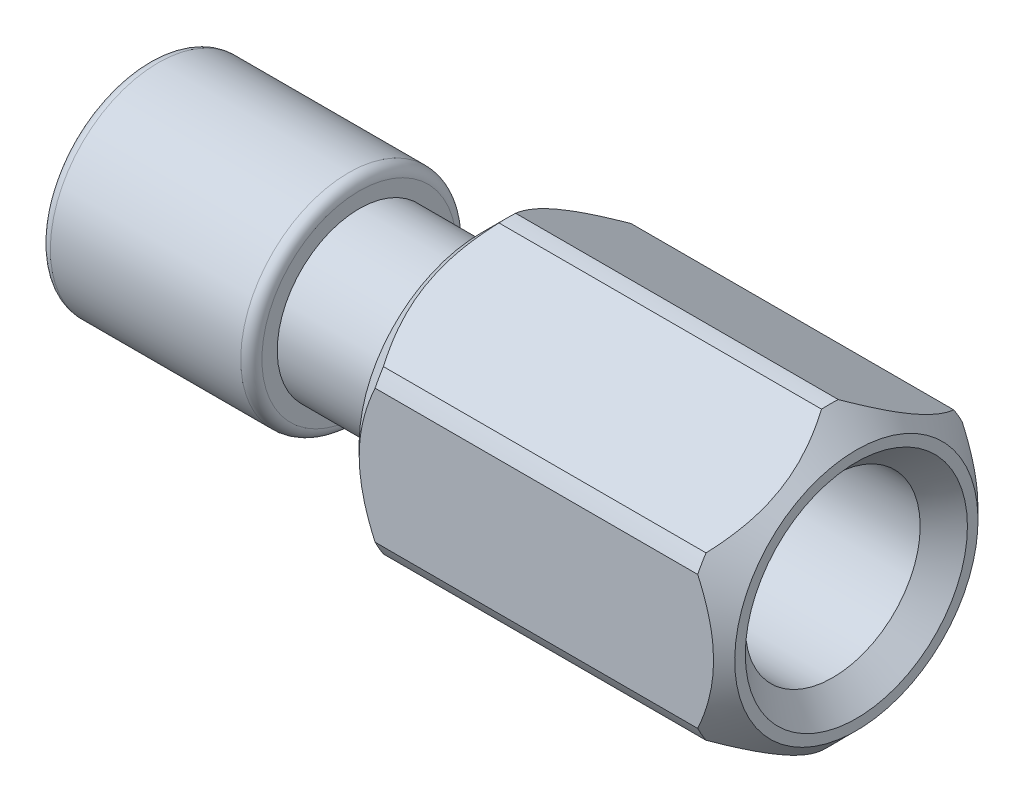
ISO-10303-21;
HEADER;
FILE_DESCRIPTION(('STEP AP214'),'2;1');
FILE_NAME('part.step','',(''),(''),'','','');
FILE_SCHEMA(('AUTOMOTIVE_DESIGN { 1 0 10303 214 1 1 1 1 }'));
ENDSEC;
DATA;
#1=APPLICATION_CONTEXT('core data for automotive mechanical design processes');
#2=APPLICATION_PROTOCOL_DEFINITION('international standard','automotive_design',2000,#1);
#3=PRODUCT_CONTEXT('',#1,'mechanical');
#4=PRODUCT('Part','Part','',(#3));
#5=PRODUCT_RELATED_PRODUCT_CATEGORY('part','',(#4));
#6=PRODUCT_DEFINITION_FORMATION('','',#4);
#7=PRODUCT_DEFINITION_CONTEXT('part definition',#1,'design');
#8=PRODUCT_DEFINITION('design','',#6,#7);
#9=PRODUCT_DEFINITION_SHAPE('','',#8);
#10=(LENGTH_UNIT() NAMED_UNIT(*) SI_UNIT(.MILLI.,.METRE.));
#11=(NAMED_UNIT(*) PLANE_ANGLE_UNIT() SI_UNIT($,.RADIAN.));
#12=(NAMED_UNIT(*) SI_UNIT($,.STERADIAN.) SOLID_ANGLE_UNIT());
#13=UNCERTAINTY_MEASURE_WITH_UNIT(LENGTH_MEASURE(1.E-05),#10,'distance_accuracy_value','');
#14=(GEOMETRIC_REPRESENTATION_CONTEXT(3) GLOBAL_UNCERTAINTY_ASSIGNED_CONTEXT((#13)) GLOBAL_UNIT_ASSIGNED_CONTEXT((#10,
#11,#12)) REPRESENTATION_CONTEXT('',''));
#15=CARTESIAN_POINT('',(0.,0.,0.));
#16=DIRECTION('',(0.,0.,1.));
#17=DIRECTION('',(1.,0.,0.));
#18=AXIS2_PLACEMENT_3D('',#15,#16,#17);
#19=CARTESIAN_POINT('',(-8.382,0.,0.));
#20=DIRECTION('',(1.,0.,0.));
#21=DIRECTION('',(0.,1.,0.));
#22=AXIS2_PLACEMENT_3D('',#19,#20,#21);
#23=CONICAL_SURFACE('',#22,3.556,0.785398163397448);
#24=CARTESIAN_POINT('',(-9.017,0.,0.));
#25=DIRECTION('',(1.,0.,0.));
#26=DIRECTION('',(0.,1.,0.));
#27=AXIS2_PLACEMENT_3D('',#24,#25,#26);
#28=CIRCLE('',#27,2.921);
#29=CARTESIAN_POINT('',(-9.017,2.921,0.));
#30=VERTEX_POINT('',#29);
#31=EDGE_CURVE('E462',#30,#30,#28,.T.);
#32=ORIENTED_EDGE('',*,*,#31,.T.);
#33=EDGE_LOOP('',(#32));
#34=FACE_BOUND('',#33,.T.);
#35=CARTESIAN_POINT('',(-8.382,0.,0.));
#36=DIRECTION('',(1.,0.,0.));
#37=DIRECTION('',(0.,1.,0.));
#38=AXIS2_PLACEMENT_3D('',#35,#36,#37);
#39=CIRCLE('',#38,3.556);
#40=CARTESIAN_POINT('',(-8.382,3.55033519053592,-0.200639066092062));
#41=VERTEX_POINT('',#40);
#42=CARTESIAN_POINT('',(-8.382,3.55033519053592,0.200639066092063));
#43=VERTEX_POINT('',#42);
#44=EDGE_CURVE('E161',#41,#43,#39,.T.);
#45=ORIENTED_EDGE('',*,*,#44,.F.);
#46=CARTESIAN_POINT('',(-8.3818,3.55055722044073,-0.200254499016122));
#47=CARTESIAN_POINT('',(-8.43296161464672,3.49375134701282,-0.298645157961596));
#48=CARTESIAN_POINT('',(-8.48060823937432,3.43606310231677,-0.398564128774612));
#49=CARTESIAN_POINT('',(-8.56688969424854,3.31877983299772,-0.601704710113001));
#50=CARTESIAN_POINT('',(-8.60548813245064,3.2591781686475,-0.704937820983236));
#51=CARTESIAN_POINT('',(-8.67084942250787,3.13911696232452,-0.912889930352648));
#52=CARTESIAN_POINT('',(-8.69775151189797,3.07867688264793,-1.01757521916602));
#53=CARTESIAN_POINT('',(-8.73833497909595,2.95677146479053,-1.22872159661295));
#54=CARTESIAN_POINT('',(-8.75203787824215,2.89530796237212,-1.33517950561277));
#55=CARTESIAN_POINT('',(-8.76460046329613,2.77647875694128,-1.54099772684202));
#56=CARTESIAN_POINT('',(-8.76446635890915,2.71913982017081,-1.64031167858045));
#57=CARTESIAN_POINT('',(-8.75185752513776,2.60477875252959,-1.83839085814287));
#58=CARTESIAN_POINT('',(-8.73937638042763,2.54775680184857,-1.93715577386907));
#59=CARTESIAN_POINT('',(-8.70303697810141,2.43465417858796,-2.13305526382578));
#60=CARTESIAN_POINT('',(-8.67917993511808,2.37857340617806,-2.23019001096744));
#61=CARTESIAN_POINT('',(-8.62164221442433,2.26768383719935,-2.42225637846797));
#62=CARTESIAN_POINT('',(-8.58795788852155,2.21287552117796,-2.51718716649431));
#63=CARTESIAN_POINT('',(-8.52532732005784,2.12309386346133,-2.67269355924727));
#64=CARTESIAN_POINT('',(-8.49866428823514,2.08771271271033,-2.73397550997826));
#65=CARTESIAN_POINT('',(-8.44236199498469,2.01769059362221,-2.85525737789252));
#66=CARTESIAN_POINT('',(-8.41273355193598,1.98304745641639,-2.91526105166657));
#67=CARTESIAN_POINT('',(-8.38180000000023,1.94870409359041,-2.97474550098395));
#68=B_SPLINE_CURVE_WITH_KNOTS('',3,(#46,#47,#48,#49,#50,#51,#52,#53,#54,#55,#56,#57,#58,#59,#60,
#61,#62,#63,#64,#65,#66,#67),.UNSPECIFIED.,.F.,.F.,(4,2,2,2,2,2,2,2,2,2,4),(0.,
0.373990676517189,0.749460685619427,1.12032967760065,1.4905929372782,1.83395154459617,
2.17748864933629,2.52098908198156,2.86461719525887,3.09140700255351,3.31739767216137),.UNSPECIFIED.);
#69=CARTESIAN_POINT('',(-8.382,1.94892612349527,-2.97436093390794));
#70=VERTEX_POINT('',#69);
#71=EDGE_CURVE('E181',#41,#70,#68,.T.);
#72=ORIENTED_EDGE('',*,*,#71,.T.);
#73=CARTESIAN_POINT('',(-8.382,1.60140906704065,-3.175));
#74=VERTEX_POINT('',#73);
#75=EDGE_CURVE('E192',#74,#70,#39,.T.);
#76=ORIENTED_EDGE('',*,*,#75,.F.);
#77=CARTESIAN_POINT('',(-7.07760151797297,-3.68006092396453,-3.175));
#78=CARTESIAN_POINT('',(-7.1453493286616,-3.59056345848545,-3.175));
#79=CARTESIAN_POINT('',(-7.21244941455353,-3.50056760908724,-3.175));
#80=CARTESIAN_POINT('',(-7.34506326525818,-3.31938150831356,-3.175));
#81=CARTESIAN_POINT('',(-7.41057663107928,-3.22819096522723,-3.175));
#82=CARTESIAN_POINT('',(-7.54019214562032,-3.04375072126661,-3.175));
#83=CARTESIAN_POINT('',(-7.60427943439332,-2.95049054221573,-3.175));
#84=CARTESIAN_POINT('',(-7.73008604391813,-2.76239141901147,-3.175));
#85=CARTESIAN_POINT('',(-7.79180553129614,-2.66755258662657,-3.175));
#86=CARTESIAN_POINT('',(-7.91584629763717,-2.47048506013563,-3.175));
#87=CARTESIAN_POINT('',(-7.97799459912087,-2.36814693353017,-3.175));
#88=CARTESIAN_POINT('',(-8.0982367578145,-2.16107936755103,-3.175));
#89=CARTESIAN_POINT('',(-8.15632996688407,-2.05634954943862,-3.175));
#90=CARTESIAN_POINT('',(-8.26721077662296,-1.84450279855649,-3.175));
#91=CARTESIAN_POINT('',(-8.32001397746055,-1.73739409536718,-3.175));
#92=CARTESIAN_POINT('',(-8.41913251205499,-1.52023971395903,-3.175));
#93=CARTESIAN_POINT('',(-8.46545080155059,-1.41019540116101,-3.175));
#94=CARTESIAN_POINT('',(-8.54643032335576,-1.19627791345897,-3.175));
#95=CARTESIAN_POINT('',(-8.58174080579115,-1.09265308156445,-3.175));
#96=CARTESIAN_POINT('',(-8.64405164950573,-0.882887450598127,-3.175));
#97=CARTESIAN_POINT('',(-8.6710514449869,-0.776746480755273,-3.175));
#98=CARTESIAN_POINT('',(-8.71487451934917,-0.564359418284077,-3.175));
#99=CARTESIAN_POINT('',(-8.7318736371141,-0.458150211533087,-3.175));
#100=CARTESIAN_POINT('',(-8.75536158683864,-0.244569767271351,-3.175));
#101=CARTESIAN_POINT('',(-8.76185227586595,-0.137198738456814,-3.175));
#102=CARTESIAN_POINT('',(-8.76383093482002,0.0736456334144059,-3.175));
#103=CARTESIAN_POINT('',(-8.75971932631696,0.177115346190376,-3.175));
#104=CARTESIAN_POINT('',(-8.74160961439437,0.383180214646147,-3.175));
#105=CARTESIAN_POINT('',(-8.72761055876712,0.485775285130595,-3.175));
#106=CARTESIAN_POINT('',(-8.69025559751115,0.691083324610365,-3.175));
#107=CARTESIAN_POINT('',(-8.66673961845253,0.793766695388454,-3.175));
#108=CARTESIAN_POINT('',(-8.61161215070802,0.996893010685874,-3.175));
#109=CARTESIAN_POINT('',(-8.58000130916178,1.0973361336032,-3.175));
#110=CARTESIAN_POINT('',(-8.50693122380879,1.30453917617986,-3.175));
#111=CARTESIAN_POINT('',(-8.46485028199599,1.41107758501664,-3.175));
#112=CARTESIAN_POINT('',(-8.37422677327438,1.62137761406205,-3.175));
#113=CARTESIAN_POINT('',(-8.32568205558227,1.72513829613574,-3.175));
#114=CARTESIAN_POINT('',(-8.22327748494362,1.93040844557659,-3.175));
#115=CARTESIAN_POINT('',(-8.16940066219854,2.03190937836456,-3.175));
#116=CARTESIAN_POINT('',(-8.05752456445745,2.23257709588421,-3.175));
#117=CARTESIAN_POINT('',(-7.99952594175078,2.33174424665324,-3.175));
#118=CARTESIAN_POINT('',(-7.88318080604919,2.52317617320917,-3.175));
#119=CARTESIAN_POINT('',(-7.82499484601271,2.61553904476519,-3.175));
#120=CARTESIAN_POINT('',(-7.70617105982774,2.79867890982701,-3.175));
#121=CARTESIAN_POINT('',(-7.64553304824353,2.88945578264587,-3.175));
#122=CARTESIAN_POINT('',(-7.52274299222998,3.06889606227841,-3.175));
#123=CARTESIAN_POINT('',(-7.46060721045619,3.15757063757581,-3.175));
#124=CARTESIAN_POINT('',(-7.33468867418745,3.33370714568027,-3.175));
#125=CARTESIAN_POINT('',(-7.27090637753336,3.42116940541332,-3.175));
#126=CARTESIAN_POINT('',(-7.20645077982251,3.50812386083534,-3.175));
#127=B_SPLINE_CURVE_WITH_KNOTS('',3,(#77,#78,#79,#80,#81,#82,#83,#84,#85,#86,#87,#88,#89,#90,
#91,#92,#93,#94,#95,#96,#97,#98,#99,#100,#101,#102,#103,#104,#105,#106,#107,#108,#109,#110,#111,
#112,#113,#114,#115,#116,#117,#118,#119,#120,#121,#122,#123,#124,#125,#126),.UNSPECIFIED.,.F.,
.F.,(4,2,2,2,2,2,2,2,2,2,2,2,2,2,2,2,2,2,2,2,2,2,2,2,4),(0.,0.336749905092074,0.673583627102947,
1.01302616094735,1.3524447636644,1.71156294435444,2.07073839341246,2.42882136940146,
2.78674060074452,3.11488011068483,3.44304195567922,3.7652466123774,4.08739432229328,
4.39755499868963,4.70774554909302,5.02338597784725,5.33900118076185,5.68237822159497,
6.02586980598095,6.37049205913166,6.71505989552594,7.04250265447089,7.36997022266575,
7.69478261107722,8.01950563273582),.UNSPECIFIED.);
#128=CARTESIAN_POINT('',(-8.382,-1.60140906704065,-3.175));
#129=VERTEX_POINT('',#128);
#130=EDGE_CURVE('E238',#74,#129,#127,.F.);
#131=ORIENTED_EDGE('',*,*,#130,.T.);
#132=CARTESIAN_POINT('',(-8.382,-1.94892612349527,-2.97436093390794));
#133=VERTEX_POINT('',#132);
#134=EDGE_CURVE('E228',#133,#129,#39,.T.);
#135=ORIENTED_EDGE('',*,*,#134,.F.);
#136=CARTESIAN_POINT('',(-8.3818,-1.94870409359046,-2.97474550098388));
#137=CARTESIAN_POINT('',(-8.43296161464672,-2.00550996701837,-2.8763548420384));
#138=CARTESIAN_POINT('',(-8.48060823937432,-2.06319821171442,-2.77643587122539));
#139=CARTESIAN_POINT('',(-8.56688969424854,-2.18048148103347,-2.573295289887));
#140=CARTESIAN_POINT('',(-8.60548813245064,-2.24008314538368,-2.47006217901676));
#141=CARTESIAN_POINT('',(-8.67084942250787,-2.36014435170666,-2.26211006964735));
#142=CARTESIAN_POINT('',(-8.69775151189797,-2.42058443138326,-2.15742478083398));
#143=CARTESIAN_POINT('',(-8.73833497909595,-2.54248984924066,-1.94627840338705));
#144=CARTESIAN_POINT('',(-8.75203787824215,-2.60395335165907,-1.83982049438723));
#145=CARTESIAN_POINT('',(-8.76460046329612,-2.72278255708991,-1.63400227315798));
#146=CARTESIAN_POINT('',(-8.76446635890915,-2.78012149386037,-1.53468832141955));
#147=CARTESIAN_POINT('',(-8.75185752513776,-2.89448256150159,-1.33660914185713));
#148=CARTESIAN_POINT('',(-8.73937638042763,-2.95150451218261,-1.23784422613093));
#149=CARTESIAN_POINT('',(-8.70303697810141,-3.06460713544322,-1.04194473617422));
#150=CARTESIAN_POINT('',(-8.67917993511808,-3.12068790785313,-0.944809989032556));
#151=CARTESIAN_POINT('',(-8.62164221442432,-3.23157747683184,-0.752743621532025));
#152=CARTESIAN_POINT('',(-8.58795788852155,-3.28638579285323,-0.657812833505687));
#153=CARTESIAN_POINT('',(-8.52532732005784,-3.37616745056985,-0.502306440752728));
#154=CARTESIAN_POINT('',(-8.49866428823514,-3.41154860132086,-0.441024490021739));
#155=CARTESIAN_POINT('',(-8.44236199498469,-3.48157072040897,-0.31974262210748));
#156=CARTESIAN_POINT('',(-8.41273355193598,-3.51621385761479,-0.259738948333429));
#157=CARTESIAN_POINT('',(-8.38180000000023,-3.55055722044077,-0.200254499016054));
#158=B_SPLINE_CURVE_WITH_KNOTS('',3,(#136,#137,#138,#139,#140,#141,#142,#143,#144,#145,#146,
#147,#148,#149,#150,#151,#152,#153,#154,#155,#156,#157),.UNSPECIFIED.,.F.,.F.,(4,2,2,2,2,2,2,2,
2,2,4),(0.,0.373990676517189,0.749460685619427,1.12032967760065,1.4905929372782,
1.83395154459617,2.17748864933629,2.52098908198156,2.86461719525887,3.09140700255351,
3.31739767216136),.UNSPECIFIED.);
#159=CARTESIAN_POINT('',(-8.382,-3.55033519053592,-0.200639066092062));
#160=VERTEX_POINT('',#159);
#161=EDGE_CURVE('E231',#133,#160,#158,.T.);
#162=ORIENTED_EDGE('',*,*,#161,.T.);
#163=CARTESIAN_POINT('',(-8.382,-3.55033519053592,0.200639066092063));
#164=VERTEX_POINT('',#163);
#165=EDGE_CURVE('E842',#164,#160,#39,.T.);
#166=ORIENTED_EDGE('',*,*,#165,.F.);
#167=CARTESIAN_POINT('',(-8.3818,-3.55055722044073,0.200254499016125));
#168=CARTESIAN_POINT('',(-8.43296161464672,-3.49375134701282,0.298645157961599));
#169=CARTESIAN_POINT('',(-8.48060823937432,-3.43606310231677,0.398564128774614));
#170=CARTESIAN_POINT('',(-8.56688969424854,-3.31877983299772,0.601704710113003));
#171=CARTESIAN_POINT('',(-8.60548813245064,-3.2591781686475,0.704937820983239));
#172=CARTESIAN_POINT('',(-8.67084942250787,-3.13911696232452,0.91288993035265));
#173=CARTESIAN_POINT('',(-8.69775151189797,-3.07867688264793,1.01757521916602));
#174=CARTESIAN_POINT('',(-8.73833497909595,-2.95677146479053,1.22872159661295));
#175=CARTESIAN_POINT('',(-8.75203787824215,-2.89530796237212,1.33517950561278));
#176=CARTESIAN_POINT('',(-8.76460046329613,-2.77647875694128,1.54099772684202));
#177=CARTESIAN_POINT('',(-8.76446635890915,-2.71913982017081,1.64031167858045));
#178=CARTESIAN_POINT('',(-8.75185752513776,-2.60477875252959,1.83839085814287));
#179=CARTESIAN_POINT('',(-8.73937638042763,-2.54775680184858,1.93715577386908));
#180=CARTESIAN_POINT('',(-8.70303697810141,-2.43465417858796,2.13305526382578));
#181=CARTESIAN_POINT('',(-8.67917993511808,-2.37857340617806,2.23019001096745));
#182=CARTESIAN_POINT('',(-8.62164221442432,-2.26768383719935,2.42225637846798));
#183=CARTESIAN_POINT('',(-8.58795788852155,-2.21287552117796,2.51718716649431));
#184=CARTESIAN_POINT('',(-8.52532732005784,-2.12309386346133,2.67269355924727));
#185=CARTESIAN_POINT('',(-8.49866428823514,-2.08771271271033,2.73397550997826));
#186=CARTESIAN_POINT('',(-8.44236199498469,-2.01769059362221,2.85525737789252));
#187=CARTESIAN_POINT('',(-8.41273355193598,-1.9830474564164,2.91526105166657));
#188=CARTESIAN_POINT('',(-8.38180000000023,-1.94870409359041,2.97474550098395));
#189=B_SPLINE_CURVE_WITH_KNOTS('',3,(#167,#168,#169,#170,#171,#172,#173,#174,#175,#176,#177,
#178,#179,#180,#181,#182,#183,#184,#185,#186,#187,#188),.UNSPECIFIED.,.F.,.F.,(4,2,2,2,2,2,2,2,
2,2,4),(0.,0.373990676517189,0.749460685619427,1.12032967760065,1.4905929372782,
1.83395154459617,2.17748864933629,2.52098908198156,2.86461719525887,3.09140700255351,
3.31739767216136),.UNSPECIFIED.);
#190=CARTESIAN_POINT('',(-8.382,-1.94892612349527,2.97436093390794));
#191=VERTEX_POINT('',#190);
#192=EDGE_CURVE('E295',#164,#191,#189,.T.);
#193=ORIENTED_EDGE('',*,*,#192,.T.);
#194=CARTESIAN_POINT('',(-8.382,-1.60140906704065,3.175));
#195=VERTEX_POINT('',#194);
#196=EDGE_CURVE('E781',#195,#191,#39,.T.);
#197=ORIENTED_EDGE('',*,*,#196,.F.);
#198=CARTESIAN_POINT('',(-7.07760151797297,-3.68006092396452,3.175));
#199=CARTESIAN_POINT('',(-7.14534932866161,-3.59056345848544,3.175));
#200=CARTESIAN_POINT('',(-7.21244941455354,-3.50056760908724,3.175));
#201=CARTESIAN_POINT('',(-7.34506326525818,-3.31938150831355,3.175));
#202=CARTESIAN_POINT('',(-7.41057663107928,-3.22819096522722,3.175));
#203=CARTESIAN_POINT('',(-7.54019214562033,-3.04375072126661,3.175));
#204=CARTESIAN_POINT('',(-7.60427943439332,-2.95049054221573,3.175));
#205=CARTESIAN_POINT('',(-7.73008604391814,-2.76239141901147,3.175));
#206=CARTESIAN_POINT('',(-7.79180553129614,-2.66755258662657,3.175));
#207=CARTESIAN_POINT('',(-7.91584629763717,-2.47048506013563,3.175));
#208=CARTESIAN_POINT('',(-7.97799459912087,-2.36814693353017,3.175));
#209=CARTESIAN_POINT('',(-8.0982367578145,-2.16107936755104,3.175));
#210=CARTESIAN_POINT('',(-8.15632996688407,-2.05634954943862,3.175));
#211=CARTESIAN_POINT('',(-8.26721077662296,-1.84450279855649,3.175));
#212=CARTESIAN_POINT('',(-8.32001397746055,-1.73739409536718,3.175));
#213=CARTESIAN_POINT('',(-8.41913251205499,-1.52023971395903,3.175));
#214=CARTESIAN_POINT('',(-8.46545080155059,-1.41019540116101,3.175));
#215=CARTESIAN_POINT('',(-8.54643032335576,-1.19627791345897,3.175));
#216=CARTESIAN_POINT('',(-8.58174080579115,-1.09265308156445,3.175));
#217=CARTESIAN_POINT('',(-8.64405164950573,-0.882887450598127,3.175));
#218=CARTESIAN_POINT('',(-8.6710514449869,-0.776746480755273,3.175));
#219=CARTESIAN_POINT('',(-8.71487451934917,-0.564359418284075,3.175));
#220=CARTESIAN_POINT('',(-8.7318736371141,-0.458150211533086,3.175));
#221=CARTESIAN_POINT('',(-8.75536158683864,-0.244569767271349,3.175));
#222=CARTESIAN_POINT('',(-8.76185227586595,-0.137198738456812,3.175));
#223=CARTESIAN_POINT('',(-8.76383093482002,0.0736456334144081,3.175));
#224=CARTESIAN_POINT('',(-8.75971932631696,0.177115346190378,3.175));
#225=CARTESIAN_POINT('',(-8.74160961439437,0.383180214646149,3.175));
#226=CARTESIAN_POINT('',(-8.72761055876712,0.485775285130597,3.175));
#227=CARTESIAN_POINT('',(-8.69025559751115,0.691083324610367,3.175));
#228=CARTESIAN_POINT('',(-8.66673961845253,0.793766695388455,3.175));
#229=CARTESIAN_POINT('',(-8.61161215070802,0.996893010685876,3.175));
#230=CARTESIAN_POINT('',(-8.58000130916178,1.0973361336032,3.175));
#231=CARTESIAN_POINT('',(-8.50693122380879,1.30453917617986,3.175));
#232=CARTESIAN_POINT('',(-8.46485028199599,1.41107758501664,3.175));
#233=CARTESIAN_POINT('',(-8.37422677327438,1.62137761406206,3.175));
#234=CARTESIAN_POINT('',(-8.32568205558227,1.72513829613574,3.175));
#235=CARTESIAN_POINT('',(-8.22327748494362,1.93040844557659,3.175));
#236=CARTESIAN_POINT('',(-8.16940066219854,2.03190937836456,3.175));
#237=CARTESIAN_POINT('',(-8.05752456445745,2.23257709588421,3.175));
#238=CARTESIAN_POINT('',(-7.99952594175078,2.33174424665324,3.175));
#239=CARTESIAN_POINT('',(-7.88318080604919,2.52317617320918,3.175));
#240=CARTESIAN_POINT('',(-7.8249948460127,2.6155390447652,3.175));
#241=CARTESIAN_POINT('',(-7.70617105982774,2.79867890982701,3.175));
#242=CARTESIAN_POINT('',(-7.64553304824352,2.88945578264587,3.175));
#243=CARTESIAN_POINT('',(-7.52274299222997,3.06889606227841,3.175));
#244=CARTESIAN_POINT('',(-7.46060721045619,3.15757063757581,3.175));
#245=CARTESIAN_POINT('',(-7.33468867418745,3.33370714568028,3.175));
#246=CARTESIAN_POINT('',(-7.27090637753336,3.42116940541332,3.175));
#247=CARTESIAN_POINT('',(-7.2064507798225,3.50812386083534,3.175));
#248=B_SPLINE_CURVE_WITH_KNOTS('',3,(#198,#199,#200,#201,#202,#203,#204,#205,#206,#207,#208,
#209,#210,#211,#212,#213,#214,#215,#216,#217,#218,#219,#220,#221,#222,#223,#224,#225,#226,#227,
#228,#229,#230,#231,#232,#233,#234,#235,#236,#237,#238,#239,#240,#241,#242,#243,#244,#245,#246,
#247),.UNSPECIFIED.,.F.,.F.,(4,2,2,2,2,2,2,2,2,2,2,2,2,2,2,2,2,2,2,2,2,2,2,2,4),(0.,
0.336749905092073,0.673583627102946,1.01302616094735,1.35244476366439,1.71156294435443,
2.07073839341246,2.42882136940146,2.78674060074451,3.11488011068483,3.44304195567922,
3.7652466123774,4.08739432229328,4.39755499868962,4.70774554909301,5.02338597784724,
5.33900118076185,5.68237822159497,6.02586980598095,6.37049205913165,6.71505989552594,
7.04250265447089,7.36997022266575,7.69478261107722,8.01950563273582),.UNSPECIFIED.);
#249=CARTESIAN_POINT('',(-8.382,1.60140906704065,3.175));
#250=VERTEX_POINT('',#249);
#251=EDGE_CURVE('E285',#195,#250,#248,.T.);
#252=ORIENTED_EDGE('',*,*,#251,.T.);
#253=CARTESIAN_POINT('',(-8.382,1.94892612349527,2.97436093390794));
#254=VERTEX_POINT('',#253);
#255=EDGE_CURVE('E193',#254,#250,#39,.T.);
#256=ORIENTED_EDGE('',*,*,#255,.F.);
#257=CARTESIAN_POINT('',(-8.3818,1.94870409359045,2.97474550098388));
#258=CARTESIAN_POINT('',(-8.43296161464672,2.00550996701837,2.8763548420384));
#259=CARTESIAN_POINT('',(-8.48060823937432,2.06319821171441,2.77643587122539));
#260=CARTESIAN_POINT('',(-8.56688969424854,2.18048148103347,2.573295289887));
#261=CARTESIAN_POINT('',(-8.60548813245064,2.24008314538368,2.47006217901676));
#262=CARTESIAN_POINT('',(-8.67084942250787,2.36014435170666,2.26211006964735));
#263=CARTESIAN_POINT('',(-8.69775151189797,2.42058443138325,2.15742478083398));
#264=CARTESIAN_POINT('',(-8.73833497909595,2.54248984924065,1.94627840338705));
#265=CARTESIAN_POINT('',(-8.75203787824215,2.60395335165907,1.83982049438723));
#266=CARTESIAN_POINT('',(-8.76460046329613,2.7227825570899,1.63400227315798));
#267=CARTESIAN_POINT('',(-8.76446635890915,2.78012149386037,1.53468832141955));
#268=CARTESIAN_POINT('',(-8.75185752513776,2.89448256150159,1.33660914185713));
#269=CARTESIAN_POINT('',(-8.73937638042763,2.95150451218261,1.23784422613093));
#270=CARTESIAN_POINT('',(-8.70303697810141,3.06460713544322,1.04194473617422));
#271=CARTESIAN_POINT('',(-8.67917993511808,3.12068790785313,0.944809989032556));
#272=CARTESIAN_POINT('',(-8.62164221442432,3.23157747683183,0.752743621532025));
#273=CARTESIAN_POINT('',(-8.58795788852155,3.28638579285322,0.657812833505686));
#274=CARTESIAN_POINT('',(-8.52532732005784,3.37616745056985,0.502306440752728));
#275=CARTESIAN_POINT('',(-8.49866428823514,3.41154860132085,0.441024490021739));
#276=CARTESIAN_POINT('',(-8.44236199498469,3.48157072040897,0.319742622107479));
#277=CARTESIAN_POINT('',(-8.41273355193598,3.51621385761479,0.259738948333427));
#278=CARTESIAN_POINT('',(-8.38180000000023,3.55055722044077,0.200254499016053));
#279=B_SPLINE_CURVE_WITH_KNOTS('',3,(#257,#258,#259,#260,#261,#262,#263,#264,#265,#266,#267,
#268,#269,#270,#271,#272,#273,#274,#275,#276,#277,#278),.UNSPECIFIED.,.F.,.F.,(4,2,2,2,2,2,2,2,
2,2,4),(0.,0.373990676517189,0.749460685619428,1.12032967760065,1.4905929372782,
1.83395154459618,2.17748864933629,2.52098908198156,2.86461719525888,3.09140700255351,
3.31739767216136),.UNSPECIFIED.);
#280=EDGE_CURVE('E273',#254,#43,#279,.T.);
#281=ORIENTED_EDGE('',*,*,#280,.T.);
#282=EDGE_LOOP('',(#45,#72,#76,#131,#135,#162,#166,#193,#197,#252,#256,#281));
#283=FACE_BOUND('',#282,.T.);
#284=ADVANCED_FACE('F16',(#34,#283),#23,.T.);
#285=CARTESIAN_POINT('',(0.,0.,0.));
#286=DIRECTION('',(1.,0.,0.));
#287=DIRECTION('',(0.,1.,0.));
#288=AXIS2_PLACEMENT_3D('',#285,#286,#287);
#289=CYLINDRICAL_SURFACE('',#288,3.556);
#290=CARTESIAN_POINT('',(-0.634999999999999,0.,0.));
#291=DIRECTION('',(1.,0.,0.));
#292=DIRECTION('',(0.,1.,0.));
#293=AXIS2_PLACEMENT_3D('',#290,#291,#292);
#294=CIRCLE('',#293,3.556);
#295=CARTESIAN_POINT('',(-0.635,3.55033519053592,-0.200639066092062));
#296=VERTEX_POINT('',#295);
#297=CARTESIAN_POINT('',(-0.635,3.55033519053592,0.200639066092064));
#298=VERTEX_POINT('',#297);
#299=EDGE_CURVE('E159',#296,#298,#294,.T.);
#300=ORIENTED_EDGE('',*,*,#299,.F.);
#301=DIRECTION('',(1.,0.,0.));
#302=VECTOR('',#301,1.);
#303=CARTESIAN_POINT('',(0.,3.55033519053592,-0.200639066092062));
#304=LINE('',#303,#302);
#305=EDGE_CURVE('E43',#296,#41,#304,.F.);
#306=ORIENTED_EDGE('',*,*,#305,.T.);
#307=ORIENTED_EDGE('',*,*,#44,.T.);
#308=DIRECTION('',(1.,0.,0.));
#309=VECTOR('',#308,1.);
#310=CARTESIAN_POINT('',(0.,3.55033519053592,0.200639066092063));
#311=LINE('',#310,#309);
#312=EDGE_CURVE('E143',#43,#298,#311,.T.);
#313=ORIENTED_EDGE('',*,*,#312,.T.);
#314=EDGE_LOOP('',(#300,#306,#307,#313));
#315=FACE_BOUND('',#314,.T.);
#316=ADVANCED_FACE('F158',(#315),#289,.T.);
#317=ORIENTED_EDGE('',*,*,#75,.T.);
#318=DIRECTION('',(1.,0.,0.));
#319=VECTOR('',#318,1.);
#320=CARTESIAN_POINT('',(0.,1.94892612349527,-2.97436093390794));
#321=LINE('',#320,#319);
#322=CARTESIAN_POINT('',(-0.634999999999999,1.94892612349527,-2.97436093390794));
#323=VERTEX_POINT('',#322);
#324=EDGE_CURVE('E258',#70,#323,#321,.T.);
#325=ORIENTED_EDGE('',*,*,#324,.T.);
#326=CARTESIAN_POINT('',(-0.635,1.60140906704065,-3.175));
#327=VERTEX_POINT('',#326);
#328=EDGE_CURVE('E168',#327,#323,#294,.T.);
#329=ORIENTED_EDGE('',*,*,#328,.F.);
#330=DIRECTION('',(1.,0.,0.));
#331=VECTOR('',#330,1.);
#332=CARTESIAN_POINT('',(0.,1.60140906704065,-3.175));
#333=LINE('',#332,#331);
#334=EDGE_CURVE('E52',#327,#74,#333,.F.);
#335=ORIENTED_EDGE('',*,*,#334,.T.);
#336=EDGE_LOOP('',(#317,#325,#329,#335));
#337=FACE_BOUND('',#336,.T.);
#338=ADVANCED_FACE('F454',(#337),#289,.T.);
#339=ORIENTED_EDGE('',*,*,#134,.T.);
#340=DIRECTION('',(1.,0.,0.));
#341=VECTOR('',#340,1.);
#342=CARTESIAN_POINT('',(0.,-1.60140906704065,-3.175));
#343=LINE('',#342,#341);
#344=CARTESIAN_POINT('',(-0.634999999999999,-1.60140906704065,-3.175));
#345=VERTEX_POINT('',#344);
#346=EDGE_CURVE('E227',#129,#345,#343,.T.);
#347=ORIENTED_EDGE('',*,*,#346,.T.);
#348=CARTESIAN_POINT('',(-0.634999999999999,-1.94892612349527,-2.97436093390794));
#349=VERTEX_POINT('',#348);
#350=EDGE_CURVE('E178',#349,#345,#294,.T.);
#351=ORIENTED_EDGE('',*,*,#350,.F.);
#352=DIRECTION('',(1.,0.,0.));
#353=VECTOR('',#352,1.);
#354=CARTESIAN_POINT('',(0.,-1.94892612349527,-2.97436093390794));
#355=LINE('',#354,#353);
#356=EDGE_CURVE('E225',#349,#133,#355,.F.);
#357=ORIENTED_EDGE('',*,*,#356,.T.);
#358=EDGE_LOOP('',(#339,#347,#351,#357));
#359=FACE_BOUND('',#358,.T.);
#360=ADVANCED_FACE('F224',(#359),#289,.T.);
#361=ORIENTED_EDGE('',*,*,#165,.T.);
#362=DIRECTION('',(1.,0.,0.));
#363=VECTOR('',#362,1.);
#364=CARTESIAN_POINT('',(0.,-3.55033519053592,-0.200639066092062));
#365=LINE('',#364,#363);
#366=CARTESIAN_POINT('',(-0.634999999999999,-3.55033519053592,-0.200639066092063));
#367=VERTEX_POINT('',#366);
#368=EDGE_CURVE('E305',#160,#367,#365,.T.);
#369=ORIENTED_EDGE('',*,*,#368,.T.);
#370=CARTESIAN_POINT('',(-0.634999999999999,-3.55033519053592,0.200639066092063));
#371=VERTEX_POINT('',#370);
#372=EDGE_CURVE('E196',#371,#367,#294,.T.);
#373=ORIENTED_EDGE('',*,*,#372,.F.);
#374=DIRECTION('',(1.,0.,0.));
#375=VECTOR('',#374,1.);
#376=CARTESIAN_POINT('',(0.,-3.55033519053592,0.200639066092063));
#377=LINE('',#376,#375);
#378=EDGE_CURVE('E306',#371,#164,#377,.F.);
#379=ORIENTED_EDGE('',*,*,#378,.T.);
#380=EDGE_LOOP('',(#361,#369,#373,#379));
#381=FACE_BOUND('',#380,.T.);
#382=ADVANCED_FACE('F663',(#381),#289,.T.);
#383=ORIENTED_EDGE('',*,*,#196,.T.);
#384=DIRECTION('',(1.,0.,0.));
#385=VECTOR('',#384,1.);
#386=CARTESIAN_POINT('',(0.,-1.94892612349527,2.97436093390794));
#387=LINE('',#386,#385);
#388=CARTESIAN_POINT('',(-0.634999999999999,-1.94892612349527,2.97436093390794));
#389=VERTEX_POINT('',#388);
#390=EDGE_CURVE('E782',#191,#389,#387,.T.);
#391=ORIENTED_EDGE('',*,*,#390,.T.);
#392=CARTESIAN_POINT('',(-0.634999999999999,-1.60140906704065,3.175));
#393=VERTEX_POINT('',#392);
#394=EDGE_CURVE('E185',#393,#389,#294,.T.);
#395=ORIENTED_EDGE('',*,*,#394,.F.);
#396=DIRECTION('',(1.,0.,0.));
#397=VECTOR('',#396,1.);
#398=CARTESIAN_POINT('',(0.,-1.60140906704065,3.175));
#399=LINE('',#398,#397);
#400=EDGE_CURVE('E768',#393,#195,#399,.F.);
#401=ORIENTED_EDGE('',*,*,#400,.T.);
#402=EDGE_LOOP('',(#383,#391,#395,#401));
#403=FACE_BOUND('',#402,.T.);
#404=ADVANCED_FACE('F671',(#403),#289,.T.);
#405=ORIENTED_EDGE('',*,*,#255,.T.);
#406=DIRECTION('',(1.,0.,0.));
#407=VECTOR('',#406,1.);
#408=CARTESIAN_POINT('',(0.,1.60140906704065,3.175));
#409=LINE('',#408,#407);
#410=CARTESIAN_POINT('',(-0.635,1.60140906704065,3.175));
#411=VERTEX_POINT('',#410);
#412=EDGE_CURVE('E764',#250,#411,#409,.T.);
#413=ORIENTED_EDGE('',*,*,#412,.T.);
#414=CARTESIAN_POINT('',(-0.635,1.94892612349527,2.97436093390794));
#415=VERTEX_POINT('',#414);
#416=EDGE_CURVE('E171',#415,#411,#294,.T.);
#417=ORIENTED_EDGE('',*,*,#416,.F.);
#418=DIRECTION('',(1.,0.,0.));
#419=VECTOR('',#418,1.);
#420=CARTESIAN_POINT('',(0.,1.94892612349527,2.97436093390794));
#421=LINE('',#420,#419);
#422=EDGE_CURVE('E146',#415,#254,#421,.F.);
#423=ORIENTED_EDGE('',*,*,#422,.T.);
#424=EDGE_LOOP('',(#405,#413,#417,#423));
#425=FACE_BOUND('',#424,.T.);
#426=ADVANCED_FACE('F335',(#425),#289,.T.);
#427=CARTESIAN_POINT('',(0.,0.,0.));
#428=DIRECTION('',(-1.,0.,0.));
#429=DIRECTION('',(0.,-1.,0.));
#430=AXIS2_PLACEMENT_3D('',#427,#428,#429);
#431=CONICAL_SURFACE('',#430,2.921,0.785398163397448);
#432=CARTESIAN_POINT('',(0.,0.,0.));
#433=DIRECTION('',(1.,0.,0.));
#434=DIRECTION('',(0.,1.,0.));
#435=AXIS2_PLACEMENT_3D('',#432,#433,#434);
#436=CIRCLE('',#435,2.921);
#437=CARTESIAN_POINT('',(0.,2.921,0.));
#438=VERTEX_POINT('',#437);
#439=EDGE_CURVE('E169',#438,#438,#436,.T.);
#440=ORIENTED_EDGE('',*,*,#439,.F.);
#441=EDGE_LOOP('',(#440));
#442=FACE_BOUND('',#441,.T.);
#443=ORIENTED_EDGE('',*,*,#328,.T.);
#444=CARTESIAN_POINT('',(-0.635200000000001,1.94870409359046,-2.97474550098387));
#445=CARTESIAN_POINT('',(-0.58403838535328,2.00550996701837,-2.8763548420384));
#446=CARTESIAN_POINT('',(-0.536391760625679,2.06319821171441,-2.77643587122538));
#447=CARTESIAN_POINT('',(-0.450110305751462,2.18048148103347,-2.573295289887));
#448=CARTESIAN_POINT('',(-0.411511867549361,2.24008314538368,-2.47006217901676));
#449=CARTESIAN_POINT('',(-0.346150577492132,2.36014435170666,-2.26211006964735));
#450=CARTESIAN_POINT('',(-0.31924848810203,2.42058443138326,-2.15742478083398));
#451=CARTESIAN_POINT('',(-0.278665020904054,2.54248984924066,-1.94627840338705));
#452=CARTESIAN_POINT('',(-0.264962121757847,2.60395335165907,-1.83982049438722));
#453=CARTESIAN_POINT('',(-0.252399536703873,2.72278255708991,-1.63400227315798));
#454=CARTESIAN_POINT('',(-0.252533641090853,2.78012149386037,-1.53468832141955));
#455=CARTESIAN_POINT('',(-0.265142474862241,2.89448256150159,-1.33660914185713));
#456=CARTESIAN_POINT('',(-0.277623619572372,2.95150451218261,-1.23784422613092));
#457=CARTESIAN_POINT('',(-0.313963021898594,3.06460713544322,-1.04194473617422));
#458=CARTESIAN_POINT('',(-0.337820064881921,3.12068790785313,-0.944809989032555));
#459=CARTESIAN_POINT('',(-0.395357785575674,3.23157747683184,-0.752743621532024));
#460=CARTESIAN_POINT('',(-0.429042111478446,3.28638579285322,-0.657812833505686));
#461=CARTESIAN_POINT('',(-0.491672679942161,3.37616745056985,-0.502306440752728));
#462=CARTESIAN_POINT('',(-0.518335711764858,3.41154860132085,-0.441024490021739));
#463=CARTESIAN_POINT('',(-0.574638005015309,3.48157072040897,-0.31974262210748));
#464=CARTESIAN_POINT('',(-0.604266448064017,3.51621385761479,-0.259738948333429));
#465=CARTESIAN_POINT('',(-0.635199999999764,3.55055722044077,-0.200254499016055));
#466=B_SPLINE_CURVE_WITH_KNOTS('',3,(#444,#445,#446,#447,#448,#449,#450,#451,#452,#453,#454,
#455,#456,#457,#458,#459,#460,#461,#462,#463,#464,#465),.UNSPECIFIED.,.F.,.F.,(4,2,2,2,2,2,2,2,
2,2,4),(0.,0.373990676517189,0.749460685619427,1.12032967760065,1.4905929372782,
1.83395154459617,2.17748864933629,2.52098908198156,2.86461719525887,3.09140700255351,
3.31739767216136),.UNSPECIFIED.);
#467=EDGE_CURVE('E10',#323,#296,#466,.T.);
#468=ORIENTED_EDGE('',*,*,#467,.T.);
#469=ORIENTED_EDGE('',*,*,#299,.T.);
#470=CARTESIAN_POINT('',(-0.6352,3.55055722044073,0.200254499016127));
#471=CARTESIAN_POINT('',(-0.58403838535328,3.49375134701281,0.298645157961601));
#472=CARTESIAN_POINT('',(-0.536391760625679,3.43606310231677,0.398564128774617));
#473=CARTESIAN_POINT('',(-0.450110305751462,3.31877983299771,0.601704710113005));
#474=CARTESIAN_POINT('',(-0.411511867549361,3.2591781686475,0.70493782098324));
#475=CARTESIAN_POINT('',(-0.346150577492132,3.13911696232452,0.912889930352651));
#476=CARTESIAN_POINT('',(-0.319248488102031,3.07867688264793,1.01757521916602));
#477=CARTESIAN_POINT('',(-0.278665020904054,2.95677146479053,1.22872159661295));
#478=CARTESIAN_POINT('',(-0.264962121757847,2.89530796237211,1.33517950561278));
#479=CARTESIAN_POINT('',(-0.252399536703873,2.77647875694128,1.54099772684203));
#480=CARTESIAN_POINT('',(-0.252533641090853,2.71913982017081,1.64031167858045));
#481=CARTESIAN_POINT('',(-0.265142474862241,2.60477875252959,1.83839085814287));
#482=CARTESIAN_POINT('',(-0.277623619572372,2.54775680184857,1.93715577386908));
#483=CARTESIAN_POINT('',(-0.313963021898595,2.43465417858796,2.13305526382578));
#484=CARTESIAN_POINT('',(-0.337820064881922,2.37857340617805,2.23019001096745));
#485=CARTESIAN_POINT('',(-0.395357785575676,2.26768383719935,2.42225637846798));
#486=CARTESIAN_POINT('',(-0.429042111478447,2.21287552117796,2.51718716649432));
#487=CARTESIAN_POINT('',(-0.491672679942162,2.12309386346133,2.67269355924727));
#488=CARTESIAN_POINT('',(-0.518335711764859,2.08771271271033,2.73397550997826));
#489=CARTESIAN_POINT('',(-0.57463800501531,2.01769059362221,2.85525737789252));
#490=CARTESIAN_POINT('',(-0.604266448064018,1.9830474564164,2.91526105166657));
#491=CARTESIAN_POINT('',(-0.635199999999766,1.94870409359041,2.97474550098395));
#492=B_SPLINE_CURVE_WITH_KNOTS('',3,(#470,#471,#472,#473,#474,#475,#476,#477,#478,#479,#480,
#481,#482,#483,#484,#485,#486,#487,#488,#489,#490,#491),.UNSPECIFIED.,.F.,.F.,(4,2,2,2,2,2,2,2,
2,2,4),(0.,0.373990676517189,0.749460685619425,1.12032967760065,1.4905929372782,
1.83395154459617,2.17748864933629,2.52098908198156,2.86461719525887,3.0914070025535,
3.31739767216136),.UNSPECIFIED.);
#493=EDGE_CURVE('E140',#298,#415,#492,.T.);
#494=ORIENTED_EDGE('',*,*,#493,.T.);
#495=ORIENTED_EDGE('',*,*,#416,.T.);
#496=CARTESIAN_POINT('',(-1.93939848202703,-3.68006092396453,3.175));
#497=CARTESIAN_POINT('',(-1.8716506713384,-3.59056345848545,3.175));
#498=CARTESIAN_POINT('',(-1.80455058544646,-3.50056760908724,3.175));
#499=CARTESIAN_POINT('',(-1.67193673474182,-3.31938150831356,3.175));
#500=CARTESIAN_POINT('',(-1.60642336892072,-3.22819096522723,3.175));
#501=CARTESIAN_POINT('',(-1.47680785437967,-3.04375072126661,3.175));
#502=CARTESIAN_POINT('',(-1.41272056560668,-2.95049054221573,3.175));
#503=CARTESIAN_POINT('',(-1.28691395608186,-2.76239141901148,3.175));
#504=CARTESIAN_POINT('',(-1.22519446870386,-2.66755258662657,3.175));
#505=CARTESIAN_POINT('',(-1.10115370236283,-2.47048506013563,3.175));
#506=CARTESIAN_POINT('',(-1.03900540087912,-2.36814693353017,3.175));
#507=CARTESIAN_POINT('',(-0.918763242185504,-2.16107936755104,3.175));
#508=CARTESIAN_POINT('',(-0.860670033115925,-2.05634954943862,3.175));
#509=CARTESIAN_POINT('',(-0.749789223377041,-1.84450279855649,3.175));
#510=CARTESIAN_POINT('',(-0.696986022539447,-1.73739409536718,3.175));
#511=CARTESIAN_POINT('',(-0.597867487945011,-1.52023971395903,3.175));
#512=CARTESIAN_POINT('',(-0.551549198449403,-1.41019540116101,3.175));
#513=CARTESIAN_POINT('',(-0.470569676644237,-1.19627791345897,3.175));
#514=CARTESIAN_POINT('',(-0.435259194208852,-1.09265308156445,3.175));
#515=CARTESIAN_POINT('',(-0.372948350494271,-0.882887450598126,3.175));
#516=CARTESIAN_POINT('',(-0.345948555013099,-0.776746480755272,3.175));
#517=CARTESIAN_POINT('',(-0.302125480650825,-0.564359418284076,3.175));
#518=CARTESIAN_POINT('',(-0.285126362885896,-0.458150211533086,3.175));
#519=CARTESIAN_POINT('',(-0.261638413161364,-0.24456976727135,3.175));
#520=CARTESIAN_POINT('',(-0.25514772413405,-0.137198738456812,3.175));
#521=CARTESIAN_POINT('',(-0.253169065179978,0.0736456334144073,3.175));
#522=CARTESIAN_POINT('',(-0.257280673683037,0.177115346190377,3.175));
#523=CARTESIAN_POINT('',(-0.275390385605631,0.383180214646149,3.175));
#524=CARTESIAN_POINT('',(-0.289389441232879,0.485775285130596,3.175));
#525=CARTESIAN_POINT('',(-0.32674440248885,0.691083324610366,3.175));
#526=CARTESIAN_POINT('',(-0.350260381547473,0.793766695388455,3.175));
#527=CARTESIAN_POINT('',(-0.405387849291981,0.996893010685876,3.175));
#528=CARTESIAN_POINT('',(-0.436998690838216,1.0973361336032,3.175));
#529=CARTESIAN_POINT('',(-0.51006877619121,1.30453917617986,3.175));
#530=CARTESIAN_POINT('',(-0.552149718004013,1.41107758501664,3.175));
#531=CARTESIAN_POINT('',(-0.642773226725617,1.62137761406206,3.175));
#532=CARTESIAN_POINT('',(-0.69131794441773,1.72513829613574,3.175));
#533=CARTESIAN_POINT('',(-0.793722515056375,1.93040844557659,3.175));
#534=CARTESIAN_POINT('',(-0.847599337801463,2.03190937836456,3.175));
#535=CARTESIAN_POINT('',(-0.959475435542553,2.23257709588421,3.175));
#536=CARTESIAN_POINT('',(-1.01747405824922,2.33174424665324,3.175));
#537=CARTESIAN_POINT('',(-1.13381919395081,2.52317617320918,3.175));
#538=CARTESIAN_POINT('',(-1.19200515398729,2.6155390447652,3.175));
#539=CARTESIAN_POINT('',(-1.31082894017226,2.79867890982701,3.175));
#540=CARTESIAN_POINT('',(-1.37146695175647,2.88945578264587,3.175));
#541=CARTESIAN_POINT('',(-1.49425700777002,3.06889606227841,3.175));
#542=CARTESIAN_POINT('',(-1.55639278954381,3.15757063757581,3.175));
#543=CARTESIAN_POINT('',(-1.68231132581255,3.33370714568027,3.175));
#544=CARTESIAN_POINT('',(-1.74609362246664,3.42116940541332,3.175));
#545=CARTESIAN_POINT('',(-1.81054922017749,3.50812386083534,3.175));
#546=B_SPLINE_CURVE_WITH_KNOTS('',3,(#496,#497,#498,#499,#500,#501,#502,#503,#504,#505,#506,
#507,#508,#509,#510,#511,#512,#513,#514,#515,#516,#517,#518,#519,#520,#521,#522,#523,#524,#525,
#526,#527,#528,#529,#530,#531,#532,#533,#534,#535,#536,#537,#538,#539,#540,#541,#542,#543,#544,
#545),.UNSPECIFIED.,.F.,.F.,(4,2,2,2,2,2,2,2,2,2,2,2,2,2,2,2,2,2,2,2,2,2,2,2,4),(0.,
0.336749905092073,0.673583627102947,1.01302616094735,1.3524447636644,1.71156294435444,
2.07073839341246,2.42882136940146,2.78674060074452,3.11488011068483,3.44304195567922,
3.7652466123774,4.08739432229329,4.39755499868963,4.70774554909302,5.02338597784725,
5.33900118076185,5.68237822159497,6.02586980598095,6.37049205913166,6.71505989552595,
7.04250265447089,7.36997022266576,7.69478261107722,8.01950563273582),.UNSPECIFIED.);
#547=EDGE_CURVE('E152',#411,#393,#546,.F.);
#548=ORIENTED_EDGE('',*,*,#547,.T.);
#549=ORIENTED_EDGE('',*,*,#394,.T.);
#550=CARTESIAN_POINT('',(-0.635200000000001,-1.94870409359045,2.97474550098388));
#551=CARTESIAN_POINT('',(-0.58403838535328,-2.00550996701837,2.8763548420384));
#552=CARTESIAN_POINT('',(-0.536391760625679,-2.06319821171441,2.77643587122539));
#553=CARTESIAN_POINT('',(-0.450110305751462,-2.18048148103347,2.573295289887));
#554=CARTESIAN_POINT('',(-0.411511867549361,-2.24008314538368,2.47006217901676));
#555=CARTESIAN_POINT('',(-0.346150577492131,-2.36014435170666,2.26211006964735));
#556=CARTESIAN_POINT('',(-0.31924848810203,-2.42058443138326,2.15742478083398));
#557=CARTESIAN_POINT('',(-0.278665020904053,-2.54248984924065,1.94627840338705));
#558=CARTESIAN_POINT('',(-0.264962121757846,-2.60395335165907,1.83982049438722));
#559=CARTESIAN_POINT('',(-0.252399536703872,-2.72278255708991,1.63400227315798));
#560=CARTESIAN_POINT('',(-0.252533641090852,-2.78012149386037,1.53468832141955));
#561=CARTESIAN_POINT('',(-0.26514247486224,-2.89448256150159,1.33660914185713));
#562=CARTESIAN_POINT('',(-0.27762361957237,-2.95150451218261,1.23784422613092));
#563=CARTESIAN_POINT('',(-0.313963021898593,-3.06460713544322,1.04194473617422));
#564=CARTESIAN_POINT('',(-0.33782006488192,-3.12068790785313,0.944809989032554));
#565=CARTESIAN_POINT('',(-0.395357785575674,-3.23157747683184,0.752743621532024));
#566=CARTESIAN_POINT('',(-0.429042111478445,-3.28638579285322,0.657812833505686));
#567=CARTESIAN_POINT('',(-0.491672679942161,-3.37616745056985,0.502306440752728));
#568=CARTESIAN_POINT('',(-0.518335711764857,-3.41154860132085,0.441024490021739));
#569=CARTESIAN_POINT('',(-0.574638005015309,-3.48157072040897,0.31974262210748));
#570=CARTESIAN_POINT('',(-0.604266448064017,-3.51621385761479,0.259738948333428));
#571=CARTESIAN_POINT('',(-0.635199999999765,-3.55055722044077,0.200254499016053));
#572=B_SPLINE_CURVE_WITH_KNOTS('',3,(#550,#551,#552,#553,#554,#555,#556,#557,#558,#559,#560,
#561,#562,#563,#564,#565,#566,#567,#568,#569,#570,#571),.UNSPECIFIED.,.F.,.F.,(4,2,2,2,2,2,2,2,
2,2,4),(0.,0.37399067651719,0.749460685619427,1.12032967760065,1.4905929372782,1.83395154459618,
2.17748864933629,2.52098908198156,2.86461719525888,3.09140700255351,3.31739767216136),.UNSPECIFIED.);
#573=EDGE_CURVE('E317',#389,#371,#572,.T.);
#574=ORIENTED_EDGE('',*,*,#573,.T.);
#575=ORIENTED_EDGE('',*,*,#372,.T.);
#576=CARTESIAN_POINT('',(-0.6352,-3.55055722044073,-0.200254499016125));
#577=CARTESIAN_POINT('',(-0.584038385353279,-3.49375134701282,-0.298645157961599));
#578=CARTESIAN_POINT('',(-0.536391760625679,-3.43606310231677,-0.398564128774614));
#579=CARTESIAN_POINT('',(-0.450110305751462,-3.31877983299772,-0.601704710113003));
#580=CARTESIAN_POINT('',(-0.41151186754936,-3.2591781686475,-0.704937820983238));
#581=CARTESIAN_POINT('',(-0.346150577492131,-3.13911696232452,-0.912889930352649));
#582=CARTESIAN_POINT('',(-0.31924848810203,-3.07867688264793,-1.01757521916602));
#583=CARTESIAN_POINT('',(-0.278665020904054,-2.95677146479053,-1.22872159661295));
#584=CARTESIAN_POINT('',(-0.264962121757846,-2.89530796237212,-1.33517950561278));
#585=CARTESIAN_POINT('',(-0.252399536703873,-2.77647875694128,-1.54099772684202));
#586=CARTESIAN_POINT('',(-0.252533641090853,-2.71913982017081,-1.64031167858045));
#587=CARTESIAN_POINT('',(-0.265142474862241,-2.60477875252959,-1.83839085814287));
#588=CARTESIAN_POINT('',(-0.277623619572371,-2.54775680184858,-1.93715577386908));
#589=CARTESIAN_POINT('',(-0.313963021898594,-2.43465417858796,-2.13305526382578));
#590=CARTESIAN_POINT('',(-0.337820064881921,-2.37857340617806,-2.23019001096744));
#591=CARTESIAN_POINT('',(-0.395357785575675,-2.26768383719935,-2.42225637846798));
#592=CARTESIAN_POINT('',(-0.429042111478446,-2.21287552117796,-2.51718716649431));
#593=CARTESIAN_POINT('',(-0.491672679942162,-2.12309386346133,-2.67269355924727));
#594=CARTESIAN_POINT('',(-0.518335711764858,-2.08771271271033,-2.73397550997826));
#595=CARTESIAN_POINT('',(-0.57463800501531,-2.01769059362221,-2.85525737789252));
#596=CARTESIAN_POINT('',(-0.604266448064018,-1.9830474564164,-2.91526105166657));
#597=CARTESIAN_POINT('',(-0.635199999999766,-1.94870409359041,-2.97474550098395));
#598=B_SPLINE_CURVE_WITH_KNOTS('',3,(#576,#577,#578,#579,#580,#581,#582,#583,#584,#585,#586,
#587,#588,#589,#590,#591,#592,#593,#594,#595,#596,#597),.UNSPECIFIED.,.F.,.F.,(4,2,2,2,2,2,2,2,
2,2,4),(0.,0.373990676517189,0.749460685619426,1.12032967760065,1.4905929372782,
1.83395154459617,2.17748864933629,2.52098908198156,2.86461719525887,3.09140700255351,
3.31739767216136),.UNSPECIFIED.);
#599=EDGE_CURVE('E219',#367,#349,#598,.T.);
#600=ORIENTED_EDGE('',*,*,#599,.T.);
#601=ORIENTED_EDGE('',*,*,#350,.T.);
#602=CARTESIAN_POINT('',(-1.93939848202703,-3.68006092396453,-3.175));
#603=CARTESIAN_POINT('',(-1.8716506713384,-3.59056345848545,-3.175));
#604=CARTESIAN_POINT('',(-1.80455058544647,-3.50056760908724,-3.175));
#605=CARTESIAN_POINT('',(-1.67193673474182,-3.31938150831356,-3.175));
#606=CARTESIAN_POINT('',(-1.60642336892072,-3.22819096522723,-3.175));
#607=CARTESIAN_POINT('',(-1.47680785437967,-3.04375072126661,-3.175));
#608=CARTESIAN_POINT('',(-1.41272056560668,-2.95049054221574,-3.175));
#609=CARTESIAN_POINT('',(-1.28691395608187,-2.76239141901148,-3.175));
#610=CARTESIAN_POINT('',(-1.22519446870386,-2.66755258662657,-3.175));
#611=CARTESIAN_POINT('',(-1.10115370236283,-2.47048506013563,-3.175));
#612=CARTESIAN_POINT('',(-1.03900540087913,-2.36814693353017,-3.175));
#613=CARTESIAN_POINT('',(-0.918763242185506,-2.16107936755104,-3.175));
#614=CARTESIAN_POINT('',(-0.860670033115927,-2.05634954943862,-3.175));
#615=CARTESIAN_POINT('',(-0.749789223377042,-1.84450279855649,-3.175));
#616=CARTESIAN_POINT('',(-0.696986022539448,-1.73739409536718,-3.175));
#617=CARTESIAN_POINT('',(-0.597867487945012,-1.52023971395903,-3.175));
#618=CARTESIAN_POINT('',(-0.551549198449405,-1.41019540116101,-3.175));
#619=CARTESIAN_POINT('',(-0.470569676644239,-1.19627791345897,-3.175));
#620=CARTESIAN_POINT('',(-0.435259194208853,-1.09265308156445,-3.175));
#621=CARTESIAN_POINT('',(-0.372948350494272,-0.882887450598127,-3.175));
#622=CARTESIAN_POINT('',(-0.3459485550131,-0.776746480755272,-3.175));
#623=CARTESIAN_POINT('',(-0.302125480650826,-0.564359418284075,-3.175));
#624=CARTESIAN_POINT('',(-0.285126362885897,-0.458150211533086,-3.175));
#625=CARTESIAN_POINT('',(-0.261638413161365,-0.244569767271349,-3.175));
#626=CARTESIAN_POINT('',(-0.255147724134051,-0.137198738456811,-3.175));
#627=CARTESIAN_POINT('',(-0.253169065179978,0.0736456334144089,-3.175));
#628=CARTESIAN_POINT('',(-0.257280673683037,0.177115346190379,-3.175));
#629=CARTESIAN_POINT('',(-0.275390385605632,0.383180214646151,-3.175));
#630=CARTESIAN_POINT('',(-0.289389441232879,0.485775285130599,-3.175));
#631=CARTESIAN_POINT('',(-0.326744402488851,0.691083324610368,-3.175));
#632=CARTESIAN_POINT('',(-0.350260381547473,0.793766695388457,-3.175));
#633=CARTESIAN_POINT('',(-0.405387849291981,0.996893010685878,-3.175));
#634=CARTESIAN_POINT('',(-0.436998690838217,1.09733613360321,-3.175));
#635=CARTESIAN_POINT('',(-0.510068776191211,1.30453917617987,-3.175));
#636=CARTESIAN_POINT('',(-0.552149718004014,1.41107758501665,-3.175));
#637=CARTESIAN_POINT('',(-0.642773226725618,1.62137761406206,-3.175));
#638=CARTESIAN_POINT('',(-0.691317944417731,1.72513829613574,-3.175));
#639=CARTESIAN_POINT('',(-0.793722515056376,1.9304084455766,-3.175));
#640=CARTESIAN_POINT('',(-0.847599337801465,2.03190937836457,-3.175));
#641=CARTESIAN_POINT('',(-0.959475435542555,2.23257709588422,-3.175));
#642=CARTESIAN_POINT('',(-1.01747405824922,2.33174424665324,-3.175));
#643=CARTESIAN_POINT('',(-1.13381919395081,2.52317617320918,-3.175));
#644=CARTESIAN_POINT('',(-1.1920051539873,2.6155390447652,-3.175));
#645=CARTESIAN_POINT('',(-1.31082894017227,2.79867890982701,-3.175));
#646=CARTESIAN_POINT('',(-1.37146695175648,2.88945578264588,-3.175));
#647=CARTESIAN_POINT('',(-1.49425700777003,3.06889606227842,-3.175));
#648=CARTESIAN_POINT('',(-1.55639278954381,3.15757063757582,-3.175));
#649=CARTESIAN_POINT('',(-1.68231132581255,3.33370714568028,-3.175));
#650=CARTESIAN_POINT('',(-1.74609362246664,3.42116940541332,-3.175));
#651=CARTESIAN_POINT('',(-1.8105492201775,3.50812386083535,-3.175));
#652=B_SPLINE_CURVE_WITH_KNOTS('',3,(#602,#603,#604,#605,#606,#607,#608,#609,#610,#611,#612,
#613,#614,#615,#616,#617,#618,#619,#620,#621,#622,#623,#624,#625,#626,#627,#628,#629,#630,#631,
#632,#633,#634,#635,#636,#637,#638,#639,#640,#641,#642,#643,#644,#645,#646,#647,#648,#649,#650,
#651),.UNSPECIFIED.,.F.,.F.,(4,2,2,2,2,2,2,2,2,2,2,2,2,2,2,2,2,2,2,2,2,2,2,2,4),(0.,
0.336749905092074,0.673583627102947,1.01302616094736,1.3524447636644,1.71156294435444,
2.07073839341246,2.42882136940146,2.78674060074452,3.11488011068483,3.44304195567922,
3.76524661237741,4.08739432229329,4.39755499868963,4.70774554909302,5.02338597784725,
5.33900118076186,5.68237822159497,6.02586980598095,6.37049205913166,6.71505989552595,
7.0425026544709,7.36997022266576,7.69478261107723,8.01950563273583),.UNSPECIFIED.);
#653=EDGE_CURVE('E31',#345,#327,#652,.T.);
#654=ORIENTED_EDGE('',*,*,#653,.T.);
#655=EDGE_LOOP('',(#443,#468,#469,#494,#495,#548,#549,#574,#575,#600,#601,#654));
#656=FACE_BOUND('',#655,.T.);
#657=ADVANCED_FACE('F166',(#442,#656),#431,.T.);
#658=CARTESIAN_POINT('',(0.,2.921,0.));
#659=DIRECTION('',(1.,0.,0.));
#660=DIRECTION('',(0.,1.,0.));
#661=AXIS2_PLACEMENT_3D('',#658,#659,#660);
#662=PLANE('',#661);
#663=CARTESIAN_POINT('',(0.,0.,0.));
#664=DIRECTION('',(1.,0.,0.));
#665=DIRECTION('',(0.,0.,-1.));
#666=AXIS2_PLACEMENT_3D('',#663,#664,#665);
#667=CIRCLE('',#666,2.667);
#668=CARTESIAN_POINT('',(0.,0.,-2.667));
#669=VERTEX_POINT('',#668);
#670=EDGE_CURVE('E427',#669,#669,#667,.T.);
#671=ORIENTED_EDGE('',*,*,#670,.F.);
#672=EDGE_LOOP('',(#671));
#673=FACE_BOUND('',#672,.T.);
#674=ORIENTED_EDGE('',*,*,#439,.T.);
#675=EDGE_LOOP('',(#674));
#676=FACE_BOUND('',#675,.T.);
#677=ADVANCED_FACE('F18',(#673,#676),#662,.T.);
#678=CARTESIAN_POINT('',(-17.018,0.,0.));
#679=DIRECTION('',(-1.,0.,0.));
#680=DIRECTION('',(0.,-1.,0.));
#681=AXIS2_PLACEMENT_3D('',#678,#679,#680);
#682=PLANE('',#681);
#683=CARTESIAN_POINT('',(-17.018,0.,0.));
#684=DIRECTION('',(1.,0.,0.));
#685=DIRECTION('',(0.,0.,-1.));
#686=AXIS2_PLACEMENT_3D('',#683,#684,#685);
#687=CIRCLE('',#686,1.190625);
#688=CARTESIAN_POINT('',(-17.018,0.,-1.190625));
#689=VERTEX_POINT('',#688);
#690=EDGE_CURVE('E431',#689,#689,#687,.T.);
#691=ORIENTED_EDGE('',*,*,#690,.T.);
#692=EDGE_LOOP('',(#691));
#693=FACE_BOUND('',#692,.T.);
#694=CARTESIAN_POINT('',(-17.018,0.,0.));
#695=DIRECTION('',(1.,0.,0.));
#696=DIRECTION('',(0.,1.,0.));
#697=AXIS2_PLACEMENT_3D('',#694,#695,#696);
#698=CIRCLE('',#697,2.3368);
#699=CARTESIAN_POINT('',(-17.018,2.3368,0.));
#700=VERTEX_POINT('',#699);
#701=EDGE_CURVE('E153',#700,#700,#698,.T.);
#702=ORIENTED_EDGE('',*,*,#701,.F.);
#703=EDGE_LOOP('',(#702));
#704=FACE_BOUND('',#703,.T.);
#705=ADVANCED_FACE('F366',(#693,#704),#682,.T.);
#706=CARTESIAN_POINT('',(-16.764,0.,0.));
#707=DIRECTION('',(1.,0.,0.));
#708=DIRECTION('',(0.,1.,0.));
#709=AXIS2_PLACEMENT_3D('',#706,#707,#708);
#710=TOROIDAL_SURFACE('',#709,2.3368,0.254);
#711=ORIENTED_EDGE('',*,*,#701,.T.);
#712=EDGE_LOOP('',(#711));
#713=FACE_BOUND('',#712,.T.);
#714=CARTESIAN_POINT('',(-16.764,0.,0.));
#715=DIRECTION('',(1.,0.,0.));
#716=DIRECTION('',(0.,1.,0.));
#717=AXIS2_PLACEMENT_3D('',#714,#715,#716);
#718=CIRCLE('',#717,2.5908);
#719=CARTESIAN_POINT('',(-16.764,2.5908,0.));
#720=VERTEX_POINT('',#719);
#721=EDGE_CURVE('E400',#720,#720,#718,.T.);
#722=ORIENTED_EDGE('',*,*,#721,.F.);
#723=EDGE_LOOP('',(#722));
#724=FACE_BOUND('',#723,.T.);
#725=ADVANCED_FACE('F436',(#713,#724),#710,.T.);
#726=CARTESIAN_POINT('',(0.,0.,0.));
#727=DIRECTION('',(1.,0.,0.));
#728=DIRECTION('',(0.,1.,0.));
#729=AXIS2_PLACEMENT_3D('',#726,#727,#728);
#730=CYLINDRICAL_SURFACE('',#729,2.5908);
#731=ORIENTED_EDGE('',*,*,#721,.T.);
#732=EDGE_LOOP('',(#731));
#733=FACE_BOUND('',#732,.T.);
#734=CARTESIAN_POINT('',(-12.192,0.,0.));
#735=DIRECTION('',(1.,0.,0.));
#736=DIRECTION('',(0.,1.,0.));
#737=AXIS2_PLACEMENT_3D('',#734,#735,#736);
#738=CIRCLE('',#737,2.5908);
#739=CARTESIAN_POINT('',(-12.192,2.5908,0.));
#740=VERTEX_POINT('',#739);
#741=EDGE_CURVE('E748',#740,#740,#738,.T.);
#742=ORIENTED_EDGE('',*,*,#741,.F.);
#743=EDGE_LOOP('',(#742));
#744=FACE_BOUND('',#743,.T.);
#745=ADVANCED_FACE('F484',(#733,#744),#730,.T.);
#746=CARTESIAN_POINT('',(-12.192,0.,0.));
#747=DIRECTION('',(1.,0.,0.));
#748=DIRECTION('',(0.,1.,0.));
#749=AXIS2_PLACEMENT_3D('',#746,#747,#748);
#750=TOROIDAL_SURFACE('',#749,2.3368,0.254);
#751=ORIENTED_EDGE('',*,*,#741,.T.);
#752=EDGE_LOOP('',(#751));
#753=FACE_BOUND('',#752,.T.);
#754=CARTESIAN_POINT('',(-11.938,0.,0.));
#755=DIRECTION('',(1.,0.,0.));
#756=DIRECTION('',(0.,1.,0.));
#757=AXIS2_PLACEMENT_3D('',#754,#755,#756);
#758=CIRCLE('',#757,2.3368);
#759=CARTESIAN_POINT('',(-11.938,2.3368,0.));
#760=VERTEX_POINT('',#759);
#761=EDGE_CURVE('E740',#760,#760,#758,.T.);
#762=ORIENTED_EDGE('',*,*,#761,.F.);
#763=EDGE_LOOP('',(#762));
#764=FACE_BOUND('',#763,.T.);
#765=ADVANCED_FACE('F489',(#753,#764),#750,.T.);
#766=CARTESIAN_POINT('',(-11.938,2.3368,0.));
#767=DIRECTION('',(1.,0.,0.));
#768=DIRECTION('',(0.,1.,0.));
#769=AXIS2_PLACEMENT_3D('',#766,#767,#768);
#770=PLANE('',#769);
#771=ORIENTED_EDGE('',*,*,#761,.T.);
#772=EDGE_LOOP('',(#771));
#773=FACE_BOUND('',#772,.T.);
#774=CARTESIAN_POINT('',(-11.938,0.,0.));
#775=DIRECTION('',(1.,0.,0.));
#776=DIRECTION('',(0.,1.,0.));
#777=AXIS2_PLACEMENT_3D('',#774,#775,#776);
#778=CIRCLE('',#777,1.9685);
#779=CARTESIAN_POINT('',(-11.938,1.9685,0.));
#780=VERTEX_POINT('',#779);
#781=EDGE_CURVE('E732',#780,#780,#778,.T.);
#782=ORIENTED_EDGE('',*,*,#781,.F.);
#783=EDGE_LOOP('',(#782));
#784=FACE_BOUND('',#783,.T.);
#785=ADVANCED_FACE('F506',(#773,#784),#770,.T.);
#786=CARTESIAN_POINT('',(0.,0.,0.));
#787=DIRECTION('',(1.,0.,0.));
#788=DIRECTION('',(0.,1.,0.));
#789=AXIS2_PLACEMENT_3D('',#786,#787,#788);
#790=CYLINDRICAL_SURFACE('',#789,1.9685);
#791=ORIENTED_EDGE('',*,*,#781,.T.);
#792=EDGE_LOOP('',(#791));
#793=FACE_BOUND('',#792,.T.);
#794=CARTESIAN_POINT('',(-9.525,0.,0.));
#795=DIRECTION('',(1.,0.,0.));
#796=DIRECTION('',(0.,1.,0.));
#797=AXIS2_PLACEMENT_3D('',#794,#795,#796);
#798=CIRCLE('',#797,1.9685);
#799=CARTESIAN_POINT('',(-9.525,1.9685,0.));
#800=VERTEX_POINT('',#799);
#801=EDGE_CURVE('E726',#800,#800,#798,.T.);
#802=ORIENTED_EDGE('',*,*,#801,.F.);
#803=EDGE_LOOP('',(#802));
#804=FACE_BOUND('',#803,.T.);
#805=ADVANCED_FACE('F516',(#793,#804),#790,.T.);
#806=CARTESIAN_POINT('',(-9.525,0.,0.));
#807=DIRECTION('',(1.,0.,0.));
#808=DIRECTION('',(0.,1.,0.));
#809=AXIS2_PLACEMENT_3D('',#806,#807,#808);
#810=TOROIDAL_SURFACE('',#809,2.4765,0.508);
#811=ORIENTED_EDGE('',*,*,#801,.T.);
#812=EDGE_LOOP('',(#811));
#813=FACE_BOUND('',#812,.T.);
#814=CARTESIAN_POINT('',(-9.017,0.,0.));
#815=DIRECTION('',(1.,0.,0.));
#816=DIRECTION('',(0.,1.,0.));
#817=AXIS2_PLACEMENT_3D('',#814,#815,#816);
#818=CIRCLE('',#817,2.4765);
#819=CARTESIAN_POINT('',(-9.017,2.4765,0.));
#820=VERTEX_POINT('',#819);
#821=EDGE_CURVE('E467',#820,#820,#818,.T.);
#822=ORIENTED_EDGE('',*,*,#821,.F.);
#823=EDGE_LOOP('',(#822));
#824=FACE_BOUND('',#823,.T.);
#825=ADVANCED_FACE('F528',(#813,#824),#810,.F.);
#826=CARTESIAN_POINT('',(-9.017,2.4765,0.));
#827=DIRECTION('',(-1.,0.,0.));
#828=DIRECTION('',(0.,-1.,0.));
#829=AXIS2_PLACEMENT_3D('',#826,#827,#828);
#830=PLANE('',#829);
#831=ORIENTED_EDGE('',*,*,#821,.T.);
#832=EDGE_LOOP('',(#831));
#833=FACE_BOUND('',#832,.T.);
#834=ORIENTED_EDGE('',*,*,#31,.F.);
#835=EDGE_LOOP('',(#834));
#836=FACE_BOUND('',#835,.T.);
#837=ADVANCED_FACE('F268',(#833,#836),#830,.T.);
#838=CARTESIAN_POINT('',(-17.018,3.66617420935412,0.));
#839=DIRECTION('',(0.,0.866025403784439,0.5));
#840=DIRECTION('',(0.,-0.5,0.866025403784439));
#841=AXIS2_PLACEMENT_3D('',#838,#839,#840);
#842=PLANE('',#841);
#843=ORIENTED_EDGE('',*,*,#422,.F.);
#844=ORIENTED_EDGE('',*,*,#493,.F.);
#845=ORIENTED_EDGE('',*,*,#312,.F.);
#846=ORIENTED_EDGE('',*,*,#280,.F.);
#847=EDGE_LOOP('',(#843,#844,#845,#846));
#848=FACE_BOUND('',#847,.T.);
#849=ADVANCED_FACE('F142',(#848),#842,.T.);
#850=CARTESIAN_POINT('',(-17.018,1.83308710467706,3.175));
#851=DIRECTION('',(0.,0.,1.));
#852=DIRECTION('',(0.,-1.,0.));
#853=AXIS2_PLACEMENT_3D('',#850,#851,#852);
#854=PLANE('',#853);
#855=ORIENTED_EDGE('',*,*,#400,.F.);
#856=ORIENTED_EDGE('',*,*,#547,.F.);
#857=ORIENTED_EDGE('',*,*,#412,.F.);
#858=ORIENTED_EDGE('',*,*,#251,.F.);
#859=EDGE_LOOP('',(#855,#856,#857,#858));
#860=FACE_BOUND('',#859,.T.);
#861=ADVANCED_FACE('F311',(#860),#854,.T.);
#862=CARTESIAN_POINT('',(-17.018,-1.83308710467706,3.175));
#863=DIRECTION('',(0.,-0.866025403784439,0.5));
#864=DIRECTION('',(0.,-0.5,-0.866025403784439));
#865=AXIS2_PLACEMENT_3D('',#862,#863,#864);
#866=PLANE('',#865);
#867=ORIENTED_EDGE('',*,*,#378,.F.);
#868=ORIENTED_EDGE('',*,*,#573,.F.);
#869=ORIENTED_EDGE('',*,*,#390,.F.);
#870=ORIENTED_EDGE('',*,*,#192,.F.);
#871=EDGE_LOOP('',(#867,#868,#869,#870));
#872=FACE_BOUND('',#871,.T.);
#873=ADVANCED_FACE('F307',(#872),#866,.T.);
#874=CARTESIAN_POINT('',(-17.018,-3.66617420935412,0.));
#875=DIRECTION('',(0.,-0.866025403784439,-0.5));
#876=DIRECTION('',(0.,0.5,-0.866025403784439));
#877=AXIS2_PLACEMENT_3D('',#874,#875,#876);
#878=PLANE('',#877);
#879=ORIENTED_EDGE('',*,*,#356,.F.);
#880=ORIENTED_EDGE('',*,*,#599,.F.);
#881=ORIENTED_EDGE('',*,*,#368,.F.);
#882=ORIENTED_EDGE('',*,*,#161,.F.);
#883=EDGE_LOOP('',(#879,#880,#881,#882));
#884=FACE_BOUND('',#883,.T.);
#885=ADVANCED_FACE('F310',(#884),#878,.T.);
#886=CARTESIAN_POINT('',(-17.018,-1.83308710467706,-3.175));
#887=DIRECTION('',(0.,0.,-1.));
#888=DIRECTION('',(0.,1.,0.));
#889=AXIS2_PLACEMENT_3D('',#886,#887,#888);
#890=PLANE('',#889);
#891=ORIENTED_EDGE('',*,*,#334,.F.);
#892=ORIENTED_EDGE('',*,*,#653,.F.);
#893=ORIENTED_EDGE('',*,*,#346,.F.);
#894=ORIENTED_EDGE('',*,*,#130,.F.);
#895=EDGE_LOOP('',(#891,#892,#893,#894));
#896=FACE_BOUND('',#895,.T.);
#897=ADVANCED_FACE('F260',(#896),#890,.T.);
#898=CARTESIAN_POINT('',(-17.018,1.83308710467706,-3.175));
#899=DIRECTION('',(0.,0.866025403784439,-0.5));
#900=DIRECTION('',(0.,0.5,0.866025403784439));
#901=AXIS2_PLACEMENT_3D('',#898,#899,#900);
#902=PLANE('',#901);
#903=ORIENTED_EDGE('',*,*,#305,.F.);
#904=ORIENTED_EDGE('',*,*,#467,.F.);
#905=ORIENTED_EDGE('',*,*,#324,.F.);
#906=ORIENTED_EDGE('',*,*,#71,.F.);
#907=EDGE_LOOP('',(#903,#904,#905,#906));
#908=FACE_BOUND('',#907,.T.);
#909=ADVANCED_FACE('F337',(#908),#902,.T.);
#910=CARTESIAN_POINT('',(0.,0.,0.));
#911=DIRECTION('',(1.,0.,0.));
#912=DIRECTION('',(0.,0.,-1.));
#913=AXIS2_PLACEMENT_3D('',#910,#911,#912);
#914=CONICAL_SURFACE('',#913,2.667,0.785398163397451);
#915=CARTESIAN_POINT('',(-0.566999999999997,0.,0.));
#916=DIRECTION('',(1.,0.,0.));
#917=DIRECTION('',(0.,0.,-1.));
#918=AXIS2_PLACEMENT_3D('',#915,#916,#917);
#919=CIRCLE('',#918,2.1);
#920=CARTESIAN_POINT('',(-0.566999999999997,0.,-2.1));
#921=VERTEX_POINT('',#920);
#922=EDGE_CURVE('E163',#921,#921,#919,.T.);
#923=ORIENTED_EDGE('',*,*,#922,.F.);
#924=EDGE_LOOP('',(#923));
#925=FACE_BOUND('',#924,.T.);
#926=ORIENTED_EDGE('',*,*,#670,.T.);
#927=EDGE_LOOP('',(#926));
#928=FACE_BOUND('',#927,.T.);
#929=ADVANCED_FACE('F476',(#925,#928),#914,.F.);
#930=CARTESIAN_POINT('',(0.,0.,0.));
#931=DIRECTION('',(1.,0.,0.));
#932=DIRECTION('',(0.,0.,-1.));
#933=AXIS2_PLACEMENT_3D('',#930,#931,#932);
#934=CYLINDRICAL_SURFACE('',#933,2.09999999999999);
#935=CARTESIAN_POINT('',(-7.366,0.,0.));
#936=DIRECTION('',(1.,0.,0.));
#937=DIRECTION('',(0.,0.,-1.));
#938=AXIS2_PLACEMENT_3D('',#935,#936,#937);
#939=CIRCLE('',#938,2.09999999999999);
#940=CARTESIAN_POINT('',(-7.366,0.,-2.09999999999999));
#941=VERTEX_POINT('',#940);
#942=EDGE_CURVE('E412',#941,#941,#939,.T.);
#943=ORIENTED_EDGE('',*,*,#942,.F.);
#944=EDGE_LOOP('',(#943));
#945=FACE_BOUND('',#944,.T.);
#946=ORIENTED_EDGE('',*,*,#922,.T.);
#947=EDGE_LOOP('',(#946));
#948=FACE_BOUND('',#947,.T.);
#949=ADVANCED_FACE('F592',(#945,#948),#934,.F.);
#950=CARTESIAN_POINT('',(-7.366,0.,0.));
#951=DIRECTION('',(1.,0.,0.));
#952=DIRECTION('',(0.,0.,-1.));
#953=AXIS2_PLACEMENT_3D('',#950,#951,#952);
#954=CONICAL_SURFACE('',#953,2.09999999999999,1.22173047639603);
#955=ORIENTED_EDGE('',*,*,#942,.T.);
#956=EDGE_LOOP('',(#955));
#957=FACE_BOUND('',#956,.T.);
#958=CARTESIAN_POINT('',(-7.69698543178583,0.,0.));
#959=DIRECTION('',(1.,0.,0.));
#960=DIRECTION('',(0.,0.,-1.));
#961=AXIS2_PLACEMENT_3D('',#958,#959,#960);
#962=CIRCLE('',#961,1.19062499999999);
#963=CARTESIAN_POINT('',(-7.69698543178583,0.,-1.19062499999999));
#964=VERTEX_POINT('',#963);
#965=EDGE_CURVE('E416',#964,#964,#962,.T.);
#966=ORIENTED_EDGE('',*,*,#965,.F.);
#967=EDGE_LOOP('',(#966));
#968=FACE_BOUND('',#967,.T.);
#969=ADVANCED_FACE('F601',(#957,#968),#954,.F.);
#970=CARTESIAN_POINT('',(0.,0.,0.));
#971=DIRECTION('',(1.,0.,0.));
#972=DIRECTION('',(0.,0.,-1.));
#973=AXIS2_PLACEMENT_3D('',#970,#971,#972);
#974=CYLINDRICAL_SURFACE('',#973,1.19062499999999);
#975=ORIENTED_EDGE('',*,*,#965,.T.);
#976=EDGE_LOOP('',(#975));
#977=FACE_BOUND('',#976,.T.);
#978=ORIENTED_EDGE('',*,*,#690,.F.);
#979=EDGE_LOOP('',(#978));
#980=FACE_BOUND('',#979,.T.);
#981=ADVANCED_FACE('F611',(#977,#980),#974,.F.);
#982=CLOSED_SHELL('',(#284,#316,#338,#360,#382,#404,#426,#657,#677,#705,#725,#745,#765,#785,
#805,#825,#837,#849,#861,#873,#885,#897,#909,#929,#949,#969,#981));
#983=MANIFOLD_SOLID_BREP('B1',#982);
#984=ADVANCED_BREP_SHAPE_REPRESENTATION('',(#18,#983),#14);
#985=SHAPE_DEFINITION_REPRESENTATION(#9,#984);
ENDSEC;
END-ISO-10303-21;
